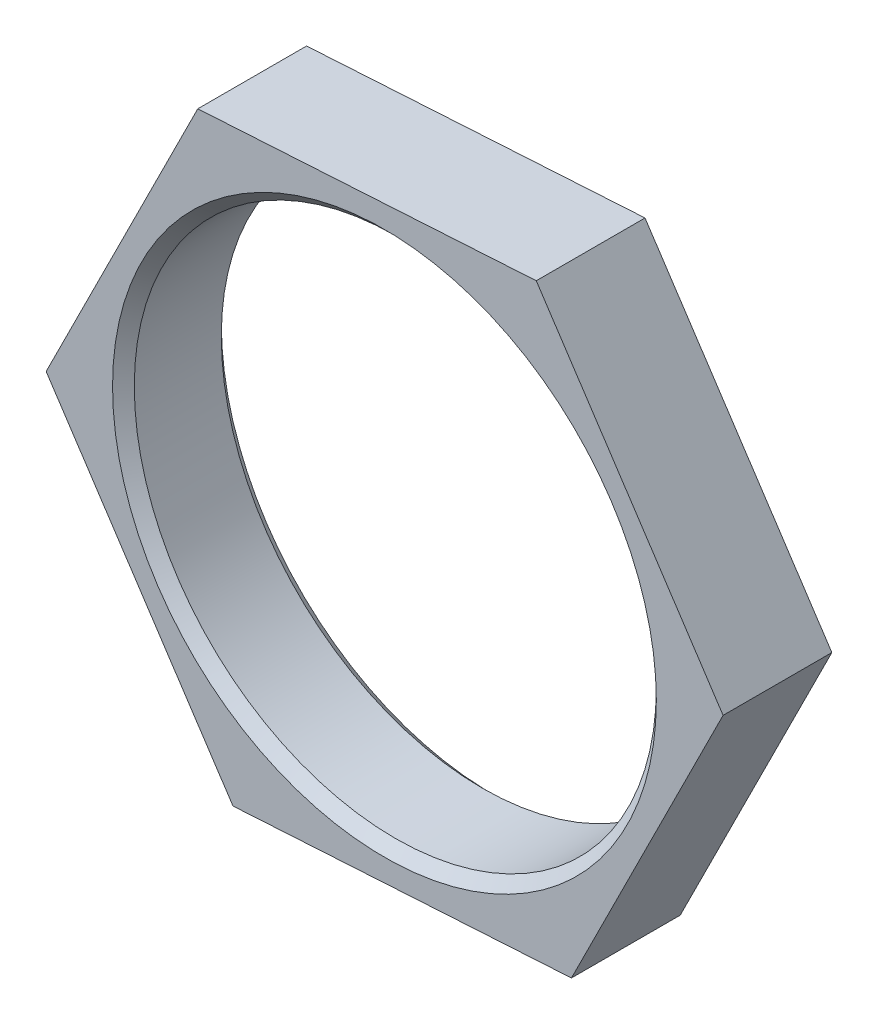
from build123d import *

# Parameters (mm, degrees)
EXTRUSION1_DEPTH      = 5
D_GAGEMENT_M221_D     = 24
D_GAGEMENT_M221_DEPTH = 7
D_GAGEMENT_M221_TIP   = 7.210327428
CHANFREIN1_SIZE       = 0.5


with BuildPart() as part:
    # Esquisse1 → Extrusion1 (new body)
    with BuildSketch(Plane.XY):
        Polygon((6.971370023, 13.942740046), (-8.589082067, 13.008753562), (-15.56045209, -0.933986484), (-6.971370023, -13.942740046), (8.589082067, -13.008753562), (15.56045209, 0.933986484), align=None)
    extrude(amount=EXTRUSION1_DEPTH)

    # D_gagement M221
    with Locations(Plane(origin=(-0.008442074, -0.000506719, 5), x_dir=(1, 0, 0), z_dir=(0, 0, 1))):
        with Locations((0, 0)):
            Hole(D_GAGEMENT_M221_D / 2, depth=D_GAGEMENT_M221_DEPTH)
            with Locations((0, 0, -(D_GAGEMENT_M221_DEPTH + D_GAGEMENT_M221_TIP / 2))):  # 118° drill point
                Cone(0, D_GAGEMENT_M221_D / 2, D_GAGEMENT_M221_TIP, mode=Mode.SUBTRACT)

    # Chanfrein1
    chanfrein1_edges = [part.edges().sort_by_distance(p)[0] for p in [
        (11.991557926, -0.000506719, 0),
        (11.991557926, -0.000506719, 5),
    ]]
    chamfer(chanfrein1_edges, length=CHANFREIN1_SIZE)


solid = part.part
